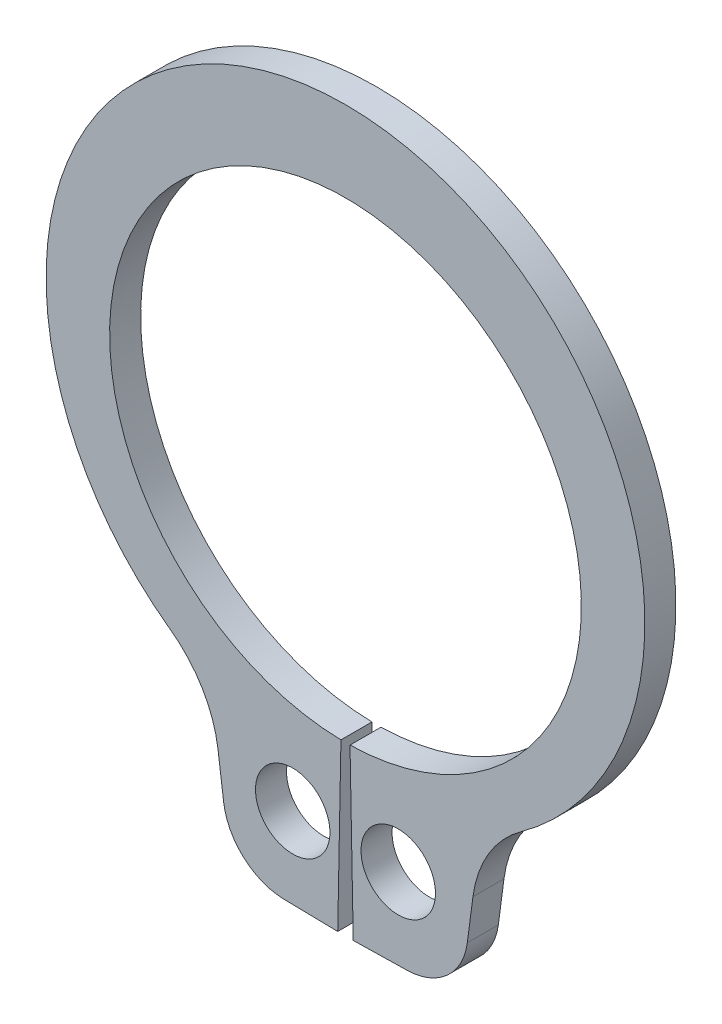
ISO-10303-21;
HEADER;
FILE_DESCRIPTION(('STEP AP214'),'2;1');
FILE_NAME('part.step','',(''),(''),'','','');
FILE_SCHEMA(('AUTOMOTIVE_DESIGN { 1 0 10303 214 1 1 1 1 }'));
ENDSEC;
DATA;
#1=APPLICATION_CONTEXT('core data for automotive mechanical design processes');
#2=APPLICATION_PROTOCOL_DEFINITION('international standard','automotive_design',2000,#1);
#3=PRODUCT_CONTEXT('',#1,'mechanical');
#4=PRODUCT('Part','Part','',(#3));
#5=PRODUCT_RELATED_PRODUCT_CATEGORY('part','',(#4));
#6=PRODUCT_DEFINITION_FORMATION('','',#4);
#7=PRODUCT_DEFINITION_CONTEXT('part definition',#1,'design');
#8=PRODUCT_DEFINITION('design','',#6,#7);
#9=PRODUCT_DEFINITION_SHAPE('','',#8);
#10=(LENGTH_UNIT() NAMED_UNIT(*) SI_UNIT(.MILLI.,.METRE.));
#11=(NAMED_UNIT(*) PLANE_ANGLE_UNIT() SI_UNIT($,.RADIAN.));
#12=(NAMED_UNIT(*) SI_UNIT($,.STERADIAN.) SOLID_ANGLE_UNIT());
#13=UNCERTAINTY_MEASURE_WITH_UNIT(LENGTH_MEASURE(1.E-05),#10,'distance_accuracy_value','');
#14=(GEOMETRIC_REPRESENTATION_CONTEXT(3) GLOBAL_UNCERTAINTY_ASSIGNED_CONTEXT((#13)) GLOBAL_UNIT_ASSIGNED_CONTEXT((#10,
#11,#12)) REPRESENTATION_CONTEXT('',''));
#15=CARTESIAN_POINT('',(0.,0.,0.));
#16=DIRECTION('',(0.,0.,1.));
#17=DIRECTION('',(1.,0.,0.));
#18=AXIS2_PLACEMENT_3D('',#15,#16,#17);
#19=CARTESIAN_POINT('',(0.,0.,-0.25));
#20=DIRECTION('',(0.,0.,1.));
#21=DIRECTION('',(1.,0.,0.));
#22=AXIS2_PLACEMENT_3D('',#19,#20,#21);
#23=CYLINDRICAL_SURFACE('',#22,1.9);
#24=CARTESIAN_POINT('',(0.,0.,0.));
#25=DIRECTION('',(0.,0.,-1.));
#26=DIRECTION('',(1.,0.,0.));
#27=AXIS2_PLACEMENT_3D('',#24,#25,#26);
#28=CIRCLE('',#27,1.9);
#29=CARTESIAN_POINT('',(-0.0365384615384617,-1.89964863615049,0.));
#30=VERTEX_POINT('',#29);
#31=CARTESIAN_POINT('',(0.0365384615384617,-1.89964863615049,0.));
#32=VERTEX_POINT('',#31);
#33=EDGE_CURVE('E154',#30,#32,#28,.T.);
#34=ORIENTED_EDGE('',*,*,#33,.F.);
#35=DIRECTION('',(0.,0.,1.));
#36=VECTOR('',#35,1.);
#37=CARTESIAN_POINT('',(-0.0365384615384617,-1.89964863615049,-0.25));
#38=LINE('',#37,#36);
#39=CARTESIAN_POINT('',(-0.0365384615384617,-1.89964863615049,-0.25));
#40=VERTEX_POINT('',#39);
#41=EDGE_CURVE('E11',#40,#30,#38,.T.);
#42=ORIENTED_EDGE('',*,*,#41,.F.);
#43=CARTESIAN_POINT('',(0.,0.,-0.25));
#44=DIRECTION('',(0.,0.,-1.));
#45=DIRECTION('',(1.,0.,0.));
#46=AXIS2_PLACEMENT_3D('',#43,#44,#45);
#47=CIRCLE('',#46,1.9);
#48=CARTESIAN_POINT('',(0.0365384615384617,-1.89964863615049,-0.25));
#49=VERTEX_POINT('',#48);
#50=EDGE_CURVE('E187',#40,#49,#47,.T.);
#51=ORIENTED_EDGE('',*,*,#50,.T.);
#52=DIRECTION('',(0.,0.,1.));
#53=VECTOR('',#52,1.);
#54=CARTESIAN_POINT('',(0.0365384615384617,-1.89964863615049,-0.25));
#55=LINE('',#54,#53);
#56=EDGE_CURVE('E36',#49,#32,#55,.T.);
#57=ORIENTED_EDGE('',*,*,#56,.T.);
#58=EDGE_LOOP('',(#34,#42,#51,#57));
#59=FACE_BOUND('',#58,.T.);
#60=ADVANCED_FACE('F33',(#59),#23,.F.);
#61=CARTESIAN_POINT('',(-0.0365384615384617,-1.89964863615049,-0.25));
#62=DIRECTION('',(0.999815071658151,-0.0192307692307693,0.));
#63=DIRECTION('',(0.0192307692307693,0.999815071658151,0.));
#64=AXIS2_PLACEMENT_3D('',#61,#62,#63);
#65=PLANE('',#64);
#66=DIRECTION('',(0.0192307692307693,0.999815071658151,0.));
#67=VECTOR('',#66,1.);
#68=CARTESIAN_POINT('',(-0.0365384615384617,-1.89964863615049,0.));
#69=LINE('',#68,#67);
#70=CARTESIAN_POINT('',(-0.0625000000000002,-3.24939898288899,0.));
#71=VERTEX_POINT('',#70);
#72=EDGE_CURVE('E185',#71,#30,#69,.T.);
#73=ORIENTED_EDGE('',*,*,#72,.F.);
#74=DIRECTION('',(0.,0.,1.));
#75=VECTOR('',#74,1.);
#76=CARTESIAN_POINT('',(-0.0625000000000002,-3.24939898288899,-0.25));
#77=LINE('',#76,#75);
#78=CARTESIAN_POINT('',(-0.0625000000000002,-3.24939898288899,-0.25));
#79=VERTEX_POINT('',#78);
#80=EDGE_CURVE('E42',#79,#71,#77,.T.);
#81=ORIENTED_EDGE('',*,*,#80,.F.);
#82=DIRECTION('',(0.0192307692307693,0.999815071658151,0.));
#83=VECTOR('',#82,1.);
#84=CARTESIAN_POINT('',(-0.0365384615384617,-1.89964863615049,-0.25));
#85=LINE('',#84,#83);
#86=EDGE_CURVE('E144',#79,#40,#85,.T.);
#87=ORIENTED_EDGE('',*,*,#86,.T.);
#88=ORIENTED_EDGE('',*,*,#41,.T.);
#89=EDGE_LOOP('',(#73,#81,#87,#88));
#90=FACE_BOUND('',#89,.T.);
#91=ADVANCED_FACE('F207',(#90),#65,.T.);
#92=CARTESIAN_POINT('',(-0.0625000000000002,-3.24939898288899,-0.25));
#93=DIRECTION('',(-0.0192307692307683,-0.999815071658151,0.));
#94=DIRECTION('',(0.999815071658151,-0.0192307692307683,0.));
#95=AXIS2_PLACEMENT_3D('',#92,#93,#94);
#96=PLANE('',#95);
#97=DIRECTION('',(0.999815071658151,-0.0192307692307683,0.));
#98=VECTOR('',#97,1.);
#99=CARTESIAN_POINT('',(-0.0625000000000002,-3.24939898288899,0.));
#100=LINE('',#99,#98);
#101=CARTESIAN_POINT('',(-0.495236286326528,-3.24107559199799,0.));
#102=VERTEX_POINT('',#101);
#103=EDGE_CURVE('E131',#102,#71,#100,.T.);
#104=ORIENTED_EDGE('',*,*,#103,.F.);
#105=DIRECTION('',(0.,0.,1.));
#106=VECTOR('',#105,1.);
#107=CARTESIAN_POINT('',(-0.495236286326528,-3.24107559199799,-0.25));
#108=LINE('',#107,#106);
#109=CARTESIAN_POINT('',(-0.495236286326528,-3.24107559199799,-0.25));
#110=VERTEX_POINT('',#109);
#111=EDGE_CURVE('E126',#110,#102,#108,.T.);
#112=ORIENTED_EDGE('',*,*,#111,.F.);
#113=DIRECTION('',(0.999815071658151,-0.0192307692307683,0.));
#114=VECTOR('',#113,1.);
#115=CARTESIAN_POINT('',(-0.0625000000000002,-3.24939898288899,-0.25));
#116=LINE('',#115,#114);
#117=EDGE_CURVE('E129',#110,#79,#116,.T.);
#118=ORIENTED_EDGE('',*,*,#117,.T.);
#119=ORIENTED_EDGE('',*,*,#80,.T.);
#120=EDGE_LOOP('',(#104,#112,#118,#119));
#121=FACE_BOUND('',#120,.T.);
#122=ADVANCED_FACE('F128',(#121),#96,.T.);
#123=CARTESIAN_POINT('',(-0.485620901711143,-2.74116805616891,-0.25));
#124=DIRECTION('',(0.,0.,1.));
#125=DIRECTION('',(1.,0.,0.));
#126=AXIS2_PLACEMENT_3D('',#123,#124,#125);
#127=CYLINDRICAL_SURFACE('',#126,0.5);
#128=CARTESIAN_POINT('',(-0.485620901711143,-2.74116805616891,0.));
#129=DIRECTION('',(0.,0.,1.));
#130=DIRECTION('',(1.,0.,0.));
#131=AXIS2_PLACEMENT_3D('',#128,#129,#130);
#132=CIRCLE('',#131,0.5);
#133=CARTESIAN_POINT('',(-0.981343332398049,-2.80643115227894,0.));
#134=VERTEX_POINT('',#133);
#135=EDGE_CURVE('E182',#134,#102,#132,.T.);
#136=ORIENTED_EDGE('',*,*,#135,.F.);
#137=DIRECTION('',(0.,0.,1.));
#138=VECTOR('',#137,1.);
#139=CARTESIAN_POINT('',(-0.981343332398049,-2.80643115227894,-0.25));
#140=LINE('',#139,#138);
#141=CARTESIAN_POINT('',(-0.981343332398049,-2.80643115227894,-0.25));
#142=VERTEX_POINT('',#141);
#143=EDGE_CURVE('E136',#142,#134,#140,.T.);
#144=ORIENTED_EDGE('',*,*,#143,.F.);
#145=CARTESIAN_POINT('',(-0.485620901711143,-2.74116805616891,-0.25));
#146=DIRECTION('',(0.,0.,1.));
#147=DIRECTION('',(1.,0.,0.));
#148=AXIS2_PLACEMENT_3D('',#145,#146,#147);
#149=CIRCLE('',#148,0.5);
#150=EDGE_CURVE('E142',#142,#110,#149,.T.);
#151=ORIENTED_EDGE('',*,*,#150,.T.);
#152=ORIENTED_EDGE('',*,*,#111,.T.);
#153=EDGE_LOOP('',(#136,#144,#151,#152));
#154=FACE_BOUND('',#153,.T.);
#155=ADVANCED_FACE('F146',(#154),#127,.T.);
#156=CARTESIAN_POINT('',(-1.02663886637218,-2.46237741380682,-0.25));
#157=DIRECTION('',(-0.99144486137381,-0.130526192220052,0.));
#158=DIRECTION('',(0.130526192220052,-0.99144486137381,0.));
#159=AXIS2_PLACEMENT_3D('',#156,#157,#158);
#160=PLANE('',#159);
#161=DIRECTION('',(0.130526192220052,-0.99144486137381,0.));
#162=VECTOR('',#161,1.);
#163=CARTESIAN_POINT('',(-1.02663886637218,-2.46237741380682,0.));
#164=LINE('',#163,#162);
#165=CARTESIAN_POINT('',(-1.02663886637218,-2.46237741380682,0.));
#166=VERTEX_POINT('',#165);
#167=EDGE_CURVE('E179',#166,#134,#164,.T.);
#168=ORIENTED_EDGE('',*,*,#167,.F.);
#169=DIRECTION('',(0.,0.,1.));
#170=VECTOR('',#169,1.);
#171=CARTESIAN_POINT('',(-1.02663886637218,-2.46237741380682,-0.25));
#172=LINE('',#171,#170);
#173=CARTESIAN_POINT('',(-1.02663886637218,-2.46237741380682,-0.25));
#174=VERTEX_POINT('',#173);
#175=EDGE_CURVE('E191',#174,#166,#172,.T.);
#176=ORIENTED_EDGE('',*,*,#175,.F.);
#177=DIRECTION('',(0.130526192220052,-0.99144486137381,0.));
#178=VECTOR('',#177,1.);
#179=CARTESIAN_POINT('',(-1.02663886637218,-2.46237741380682,-0.25));
#180=LINE('',#179,#178);
#181=EDGE_CURVE('E147',#174,#142,#180,.T.);
#182=ORIENTED_EDGE('',*,*,#181,.T.);
#183=ORIENTED_EDGE('',*,*,#143,.T.);
#184=EDGE_LOOP('',(#168,#176,#182,#183));
#185=FACE_BOUND('',#184,.T.);
#186=ADVANCED_FACE('F220',(#185),#160,.T.);
#187=CARTESIAN_POINT('',(-1.96810326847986,-2.58632355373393,-0.25));
#188=DIRECTION('',(0.,0.,1.));
#189=DIRECTION('',(1.,0.,0.));
#190=AXIS2_PLACEMENT_3D('',#187,#188,#189);
#191=CYLINDRICAL_SURFACE('',#190,0.949588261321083);
#192=CARTESIAN_POINT('',(-1.96810326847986,-2.58632355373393,0.));
#193=DIRECTION('',(0.,0.,-1.));
#194=DIRECTION('',(1.,0.,0.));
#195=AXIS2_PLACEMENT_3D('',#192,#193,#194);
#196=CIRCLE('',#195,0.949588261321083);
#197=CARTESIAN_POINT('',(-1.41208279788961,-1.8165449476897,0.));
#198=VERTEX_POINT('',#197);
#199=EDGE_CURVE('E176',#198,#166,#196,.T.);
#200=ORIENTED_EDGE('',*,*,#199,.F.);
#201=DIRECTION('',(0.,0.,1.));
#202=VECTOR('',#201,1.);
#203=CARTESIAN_POINT('',(-1.41208279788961,-1.8165449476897,-0.25));
#204=LINE('',#203,#202);
#205=CARTESIAN_POINT('',(-1.41208279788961,-1.8165449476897,-0.25));
#206=VERTEX_POINT('',#205);
#207=EDGE_CURVE('E193',#206,#198,#204,.T.);
#208=ORIENTED_EDGE('',*,*,#207,.F.);
#209=CARTESIAN_POINT('',(-1.96810326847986,-2.58632355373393,-0.25));
#210=DIRECTION('',(0.,0.,-1.));
#211=DIRECTION('',(1.,0.,0.));
#212=AXIS2_PLACEMENT_3D('',#209,#210,#211);
#213=CIRCLE('',#212,0.949588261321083);
#214=EDGE_CURVE('E149',#206,#174,#213,.T.);
#215=ORIENTED_EDGE('',*,*,#214,.T.);
#216=ORIENTED_EDGE('',*,*,#175,.T.);
#217=EDGE_LOOP('',(#200,#208,#215,#216));
#218=FACE_BOUND('',#217,.T.);
#219=ADVANCED_FACE('F223',(#218),#191,.F.);
#220=CARTESIAN_POINT('',(0.,0.138403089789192,-0.25));
#221=DIRECTION('',(0.,0.,1.));
#222=DIRECTION('',(1.,0.,0.));
#223=AXIS2_PLACEMENT_3D('',#220,#221,#222);
#224=CYLINDRICAL_SURFACE('',#223,2.41159691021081);
#225=CARTESIAN_POINT('',(0.,0.138403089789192,0.));
#226=DIRECTION('',(0.,0.,1.));
#227=DIRECTION('',(1.,0.,0.));
#228=AXIS2_PLACEMENT_3D('',#225,#226,#227);
#229=CIRCLE('',#228,2.41159691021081);
#230=CARTESIAN_POINT('',(1.41208279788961,-1.8165449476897,0.));
#231=VERTEX_POINT('',#230);
#232=EDGE_CURVE('E173',#231,#198,#229,.T.);
#233=ORIENTED_EDGE('',*,*,#232,.F.);
#234=DIRECTION('',(0.,0.,1.));
#235=VECTOR('',#234,1.);
#236=CARTESIAN_POINT('',(1.41208279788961,-1.8165449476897,-0.25));
#237=LINE('',#236,#235);
#238=CARTESIAN_POINT('',(1.41208279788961,-1.8165449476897,-0.25));
#239=VERTEX_POINT('',#238);
#240=EDGE_CURVE('E195',#239,#231,#237,.T.);
#241=ORIENTED_EDGE('',*,*,#240,.F.);
#242=CARTESIAN_POINT('',(0.,0.138403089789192,-0.25));
#243=DIRECTION('',(0.,0.,1.));
#244=DIRECTION('',(1.,0.,0.));
#245=AXIS2_PLACEMENT_3D('',#242,#243,#244);
#246=CIRCLE('',#245,2.41159691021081);
#247=EDGE_CURVE('E297',#239,#206,#246,.T.);
#248=ORIENTED_EDGE('',*,*,#247,.T.);
#249=ORIENTED_EDGE('',*,*,#207,.T.);
#250=EDGE_LOOP('',(#233,#241,#248,#249));
#251=FACE_BOUND('',#250,.T.);
#252=ADVANCED_FACE('F227',(#251),#224,.T.);
#253=CARTESIAN_POINT('',(1.96810326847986,-2.58632355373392,-0.25));
#254=DIRECTION('',(0.,0.,1.));
#255=DIRECTION('',(1.,0.,0.));
#256=AXIS2_PLACEMENT_3D('',#253,#254,#255);
#257=CYLINDRICAL_SURFACE('',#256,0.949588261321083);
#258=CARTESIAN_POINT('',(1.96810326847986,-2.58632355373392,0.));
#259=DIRECTION('',(0.,0.,-1.));
#260=DIRECTION('',(1.,0.,0.));
#261=AXIS2_PLACEMENT_3D('',#258,#259,#260);
#262=CIRCLE('',#261,0.949588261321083);
#263=CARTESIAN_POINT('',(1.02663886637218,-2.46237741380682,0.));
#264=VERTEX_POINT('',#263);
#265=EDGE_CURVE('E170',#264,#231,#262,.T.);
#266=ORIENTED_EDGE('',*,*,#265,.F.);
#267=DIRECTION('',(0.,0.,1.));
#268=VECTOR('',#267,1.);
#269=CARTESIAN_POINT('',(1.02663886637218,-2.46237741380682,-0.25));
#270=LINE('',#269,#268);
#271=CARTESIAN_POINT('',(1.02663886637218,-2.46237741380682,-0.25));
#272=VERTEX_POINT('',#271);
#273=EDGE_CURVE('E197',#272,#264,#270,.T.);
#274=ORIENTED_EDGE('',*,*,#273,.F.);
#275=CARTESIAN_POINT('',(1.96810326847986,-2.58632355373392,-0.25));
#276=DIRECTION('',(0.,0.,-1.));
#277=DIRECTION('',(1.,0.,0.));
#278=AXIS2_PLACEMENT_3D('',#275,#276,#277);
#279=CIRCLE('',#278,0.949588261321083);
#280=EDGE_CURVE('E294',#272,#239,#279,.T.);
#281=ORIENTED_EDGE('',*,*,#280,.T.);
#282=ORIENTED_EDGE('',*,*,#240,.T.);
#283=EDGE_LOOP('',(#266,#274,#281,#282));
#284=FACE_BOUND('',#283,.T.);
#285=ADVANCED_FACE('F231',(#284),#257,.F.);
#286=CARTESIAN_POINT('',(1.02663886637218,-2.46237741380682,-0.25));
#287=DIRECTION('',(0.99144486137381,-0.130526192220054,0.));
#288=DIRECTION('',(0.130526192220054,0.99144486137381,0.));
#289=AXIS2_PLACEMENT_3D('',#286,#287,#288);
#290=PLANE('',#289);
#291=DIRECTION('',(0.130526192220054,0.99144486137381,0.));
#292=VECTOR('',#291,1.);
#293=CARTESIAN_POINT('',(1.02663886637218,-2.46237741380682,0.));
#294=LINE('',#293,#292);
#295=CARTESIAN_POINT('',(0.981343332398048,-2.80643115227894,0.));
#296=VERTEX_POINT('',#295);
#297=EDGE_CURVE('E167',#296,#264,#294,.T.);
#298=ORIENTED_EDGE('',*,*,#297,.F.);
#299=DIRECTION('',(0.,0.,1.));
#300=VECTOR('',#299,1.);
#301=CARTESIAN_POINT('',(0.981343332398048,-2.80643115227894,-0.25));
#302=LINE('',#301,#300);
#303=CARTESIAN_POINT('',(0.981343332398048,-2.80643115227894,-0.25));
#304=VERTEX_POINT('',#303);
#305=EDGE_CURVE('E199',#304,#296,#302,.T.);
#306=ORIENTED_EDGE('',*,*,#305,.F.);
#307=DIRECTION('',(0.130526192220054,0.99144486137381,0.));
#308=VECTOR('',#307,1.);
#309=CARTESIAN_POINT('',(1.02663886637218,-2.46237741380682,-0.25));
#310=LINE('',#309,#308);
#311=EDGE_CURVE('E291',#304,#272,#310,.T.);
#312=ORIENTED_EDGE('',*,*,#311,.T.);
#313=ORIENTED_EDGE('',*,*,#273,.T.);
#314=EDGE_LOOP('',(#298,#306,#312,#313));
#315=FACE_BOUND('',#314,.T.);
#316=ADVANCED_FACE('F235',(#315),#290,.T.);
#317=CARTESIAN_POINT('',(0.485620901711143,-2.74116805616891,-0.25));
#318=DIRECTION('',(0.,0.,1.));
#319=DIRECTION('',(1.,0.,0.));
#320=AXIS2_PLACEMENT_3D('',#317,#318,#319);
#321=CYLINDRICAL_SURFACE('',#320,0.5);
#322=CARTESIAN_POINT('',(0.485620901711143,-2.74116805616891,0.));
#323=DIRECTION('',(0.,0.,1.));
#324=DIRECTION('',(-1.,0.,0.));
#325=AXIS2_PLACEMENT_3D('',#322,#323,#324);
#326=CIRCLE('',#325,0.5);
#327=CARTESIAN_POINT('',(0.495236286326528,-3.24107559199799,0.));
#328=VERTEX_POINT('',#327);
#329=EDGE_CURVE('E164',#328,#296,#326,.T.);
#330=ORIENTED_EDGE('',*,*,#329,.F.);
#331=DIRECTION('',(0.,0.,1.));
#332=VECTOR('',#331,1.);
#333=CARTESIAN_POINT('',(0.495236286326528,-3.24107559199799,-0.25));
#334=LINE('',#333,#332);
#335=CARTESIAN_POINT('',(0.495236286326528,-3.24107559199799,-0.25));
#336=VERTEX_POINT('',#335);
#337=EDGE_CURVE('E201',#336,#328,#334,.T.);
#338=ORIENTED_EDGE('',*,*,#337,.F.);
#339=CARTESIAN_POINT('',(0.485620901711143,-2.74116805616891,-0.25));
#340=DIRECTION('',(0.,0.,1.));
#341=DIRECTION('',(-1.,0.,0.));
#342=AXIS2_PLACEMENT_3D('',#339,#340,#341);
#343=CIRCLE('',#342,0.5);
#344=EDGE_CURVE('E288',#336,#304,#343,.T.);
#345=ORIENTED_EDGE('',*,*,#344,.T.);
#346=ORIENTED_EDGE('',*,*,#305,.T.);
#347=EDGE_LOOP('',(#330,#338,#345,#346));
#348=FACE_BOUND('',#347,.T.);
#349=ADVANCED_FACE('F239',(#348),#321,.T.);
#350=CARTESIAN_POINT('',(0.0624999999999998,-3.24939898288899,-0.25));
#351=DIRECTION('',(0.0192307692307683,-0.999815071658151,0.));
#352=DIRECTION('',(0.999815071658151,0.0192307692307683,0.));
#353=AXIS2_PLACEMENT_3D('',#350,#351,#352);
#354=PLANE('',#353);
#355=DIRECTION('',(0.999815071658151,0.0192307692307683,0.));
#356=VECTOR('',#355,1.);
#357=CARTESIAN_POINT('',(0.0624999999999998,-3.24939898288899,0.));
#358=LINE('',#357,#356);
#359=CARTESIAN_POINT('',(0.0624999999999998,-3.24939898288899,0.));
#360=VERTEX_POINT('',#359);
#361=EDGE_CURVE('E161',#360,#328,#358,.T.);
#362=ORIENTED_EDGE('',*,*,#361,.F.);
#363=DIRECTION('',(0.,0.,1.));
#364=VECTOR('',#363,1.);
#365=CARTESIAN_POINT('',(0.0624999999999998,-3.24939898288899,-0.25));
#366=LINE('',#365,#364);
#367=CARTESIAN_POINT('',(0.0624999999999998,-3.24939898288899,-0.25));
#368=VERTEX_POINT('',#367);
#369=EDGE_CURVE('E202',#368,#360,#366,.T.);
#370=ORIENTED_EDGE('',*,*,#369,.F.);
#371=DIRECTION('',(0.999815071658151,0.0192307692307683,0.));
#372=VECTOR('',#371,1.);
#373=CARTESIAN_POINT('',(0.0624999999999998,-3.24939898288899,-0.25));
#374=LINE('',#373,#372);
#375=EDGE_CURVE('E285',#368,#336,#374,.T.);
#376=ORIENTED_EDGE('',*,*,#375,.T.);
#377=ORIENTED_EDGE('',*,*,#337,.T.);
#378=EDGE_LOOP('',(#362,#370,#376,#377));
#379=FACE_BOUND('',#378,.T.);
#380=ADVANCED_FACE('F243',(#379),#354,.T.);
#381=CARTESIAN_POINT('',(0.0365384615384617,-1.89964863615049,-0.25));
#382=DIRECTION('',(-0.999815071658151,-0.019230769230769,0.));
#383=DIRECTION('',(0.019230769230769,-0.999815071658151,0.));
#384=AXIS2_PLACEMENT_3D('',#381,#382,#383);
#385=PLANE('',#384);
#386=DIRECTION('',(0.019230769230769,-0.999815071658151,0.));
#387=VECTOR('',#386,1.);
#388=CARTESIAN_POINT('',(0.0365384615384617,-1.89964863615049,0.));
#389=LINE('',#388,#387);
#390=EDGE_CURVE('E157',#32,#360,#389,.T.);
#391=ORIENTED_EDGE('',*,*,#390,.F.);
#392=ORIENTED_EDGE('',*,*,#56,.F.);
#393=DIRECTION('',(0.019230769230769,-0.999815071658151,0.));
#394=VECTOR('',#393,1.);
#395=CARTESIAN_POINT('',(0.0365384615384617,-1.89964863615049,-0.25));
#396=LINE('',#395,#394);
#397=EDGE_CURVE('E283',#49,#368,#396,.T.);
#398=ORIENTED_EDGE('',*,*,#397,.T.);
#399=ORIENTED_EDGE('',*,*,#369,.T.);
#400=EDGE_LOOP('',(#391,#392,#398,#399));
#401=FACE_BOUND('',#400,.T.);
#402=ADVANCED_FACE('F204',(#401),#385,.T.);
#403=CARTESIAN_POINT('',(0.,0.,-0.25));
#404=DIRECTION('',(0.,0.,1.));
#405=DIRECTION('',(1.,0.,0.));
#406=AXIS2_PLACEMENT_3D('',#403,#404,#405);
#407=PLANE('',#406);
#408=CARTESIAN_POINT('',(-0.425,-2.59036676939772,-0.25));
#409=DIRECTION('',(0.,0.,1.));
#410=DIRECTION('',(1.,0.,0.));
#411=AXIS2_PLACEMENT_3D('',#408,#409,#410);
#412=CIRCLE('',#411,0.3);
#413=CARTESIAN_POINT('',(-0.125,-2.59036676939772,-0.25));
#414=VERTEX_POINT('',#413);
#415=EDGE_CURVE('E270',#414,#414,#412,.T.);
#416=ORIENTED_EDGE('',*,*,#415,.T.);
#417=EDGE_LOOP('',(#416));
#418=FACE_BOUND('',#417,.T.);
#419=CARTESIAN_POINT('',(0.425,-2.59036676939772,-0.25));
#420=DIRECTION('',(0.,0.,1.));
#421=DIRECTION('',(1.,0.,0.));
#422=AXIS2_PLACEMENT_3D('',#419,#420,#421);
#423=CIRCLE('',#422,0.3);
#424=CARTESIAN_POINT('',(0.725,-2.59036676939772,-0.25));
#425=VERTEX_POINT('',#424);
#426=EDGE_CURVE('E158',#425,#425,#423,.T.);
#427=ORIENTED_EDGE('',*,*,#426,.T.);
#428=EDGE_LOOP('',(#427));
#429=FACE_BOUND('',#428,.T.);
#430=ORIENTED_EDGE('',*,*,#50,.F.);
#431=ORIENTED_EDGE('',*,*,#86,.F.);
#432=ORIENTED_EDGE('',*,*,#117,.F.);
#433=ORIENTED_EDGE('',*,*,#150,.F.);
#434=ORIENTED_EDGE('',*,*,#181,.F.);
#435=ORIENTED_EDGE('',*,*,#214,.F.);
#436=ORIENTED_EDGE('',*,*,#247,.F.);
#437=ORIENTED_EDGE('',*,*,#280,.F.);
#438=ORIENTED_EDGE('',*,*,#311,.F.);
#439=ORIENTED_EDGE('',*,*,#344,.F.);
#440=ORIENTED_EDGE('',*,*,#375,.F.);
#441=ORIENTED_EDGE('',*,*,#397,.F.);
#442=EDGE_LOOP('',(#430,#431,#432,#433,#434,#435,#436,#437,#438,#439,#440,#441));
#443=FACE_BOUND('',#442,.T.);
#444=ADVANCED_FACE('F140',(#418,#429,#443),#407,.F.);
#445=CARTESIAN_POINT('',(0.,0.,0.));
#446=DIRECTION('',(0.,0.,1.));
#447=DIRECTION('',(1.,0.,0.));
#448=AXIS2_PLACEMENT_3D('',#445,#446,#447);
#449=PLANE('',#448);
#450=CARTESIAN_POINT('',(-0.425,-2.59036676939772,0.));
#451=DIRECTION('',(0.,0.,1.));
#452=DIRECTION('',(1.,0.,0.));
#453=AXIS2_PLACEMENT_3D('',#450,#451,#452);
#454=CIRCLE('',#453,0.3);
#455=CARTESIAN_POINT('',(-0.125,-2.59036676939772,0.));
#456=VERTEX_POINT('',#455);
#457=EDGE_CURVE('E273',#456,#456,#454,.T.);
#458=ORIENTED_EDGE('',*,*,#457,.F.);
#459=EDGE_LOOP('',(#458));
#460=FACE_BOUND('',#459,.T.);
#461=CARTESIAN_POINT('',(0.425,-2.59036676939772,0.));
#462=DIRECTION('',(0.,0.,1.));
#463=DIRECTION('',(1.,0.,0.));
#464=AXIS2_PLACEMENT_3D('',#461,#462,#463);
#465=CIRCLE('',#464,0.3);
#466=CARTESIAN_POINT('',(0.725,-2.59036676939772,0.));
#467=VERTEX_POINT('',#466);
#468=EDGE_CURVE('E275',#467,#467,#465,.T.);
#469=ORIENTED_EDGE('',*,*,#468,.F.);
#470=EDGE_LOOP('',(#469));
#471=FACE_BOUND('',#470,.T.);
#472=ORIENTED_EDGE('',*,*,#33,.T.);
#473=ORIENTED_EDGE('',*,*,#390,.T.);
#474=ORIENTED_EDGE('',*,*,#361,.T.);
#475=ORIENTED_EDGE('',*,*,#329,.T.);
#476=ORIENTED_EDGE('',*,*,#297,.T.);
#477=ORIENTED_EDGE('',*,*,#265,.T.);
#478=ORIENTED_EDGE('',*,*,#232,.T.);
#479=ORIENTED_EDGE('',*,*,#199,.T.);
#480=ORIENTED_EDGE('',*,*,#167,.T.);
#481=ORIENTED_EDGE('',*,*,#135,.T.);
#482=ORIENTED_EDGE('',*,*,#103,.T.);
#483=ORIENTED_EDGE('',*,*,#72,.T.);
#484=EDGE_LOOP('',(#472,#473,#474,#475,#476,#477,#478,#479,#480,#481,#482,#483));
#485=FACE_BOUND('',#484,.T.);
#486=ADVANCED_FACE('F206',(#460,#471,#485),#449,.T.);
#487=CARTESIAN_POINT('',(0.425,-2.59036676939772,-0.25));
#488=DIRECTION('',(0.,0.,1.));
#489=DIRECTION('',(1.,0.,0.));
#490=AXIS2_PLACEMENT_3D('',#487,#488,#489);
#491=CYLINDRICAL_SURFACE('',#490,0.3);
#492=ORIENTED_EDGE('',*,*,#426,.F.);
#493=EDGE_LOOP('',(#492));
#494=FACE_BOUND('',#493,.T.);
#495=ORIENTED_EDGE('',*,*,#468,.T.);
#496=EDGE_LOOP('',(#495));
#497=FACE_BOUND('',#496,.T.);
#498=ADVANCED_FACE('F255',(#494,#497),#491,.F.);
#499=CARTESIAN_POINT('',(-0.425,-2.59036676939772,-0.25));
#500=DIRECTION('',(0.,0.,1.));
#501=DIRECTION('',(1.,0.,0.));
#502=AXIS2_PLACEMENT_3D('',#499,#500,#501);
#503=CYLINDRICAL_SURFACE('',#502,0.3);
#504=ORIENTED_EDGE('',*,*,#415,.F.);
#505=EDGE_LOOP('',(#504));
#506=FACE_BOUND('',#505,.T.);
#507=ORIENTED_EDGE('',*,*,#457,.T.);
#508=EDGE_LOOP('',(#507));
#509=FACE_BOUND('',#508,.T.);
#510=ADVANCED_FACE('F262',(#506,#509),#503,.F.);
#511=CLOSED_SHELL('',(#60,#91,#122,#155,#186,#219,#252,#285,#316,#349,#380,#402,#444,#486,#498,#510));
#512=MANIFOLD_SOLID_BREP('B2',#511);
#513=ADVANCED_BREP_SHAPE_REPRESENTATION('',(#18,#512),#14);
#514=SHAPE_DEFINITION_REPRESENTATION(#9,#513);
ENDSEC;
END-ISO-10303-21;
